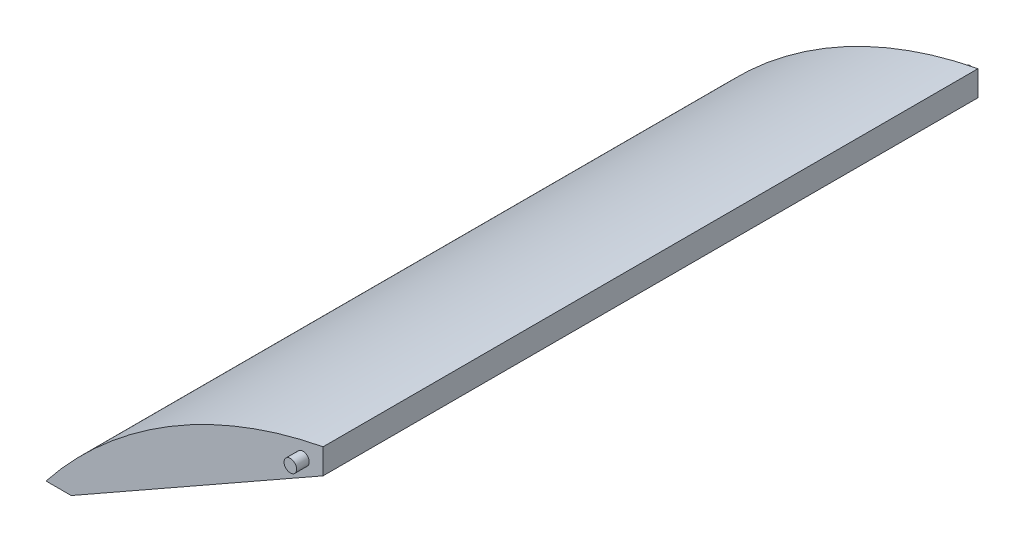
ISO-10303-21;
HEADER;
FILE_DESCRIPTION(('STEP AP214'),'2;1');
FILE_NAME('part.step','',(''),(''),'','','');
FILE_SCHEMA(('AUTOMOTIVE_DESIGN { 1 0 10303 214 1 1 1 1 }'));
ENDSEC;
DATA;
#1=APPLICATION_CONTEXT('core data for automotive mechanical design processes');
#2=APPLICATION_PROTOCOL_DEFINITION('international standard','automotive_design',2000,#1);
#3=PRODUCT_CONTEXT('',#1,'mechanical');
#4=PRODUCT('Part','Part','',(#3));
#5=PRODUCT_RELATED_PRODUCT_CATEGORY('part','',(#4));
#6=PRODUCT_DEFINITION_FORMATION('','',#4);
#7=PRODUCT_DEFINITION_CONTEXT('part definition',#1,'design');
#8=PRODUCT_DEFINITION('design','',#6,#7);
#9=PRODUCT_DEFINITION_SHAPE('','',#8);
#10=(LENGTH_UNIT() NAMED_UNIT(*) SI_UNIT(.MILLI.,.METRE.));
#11=(NAMED_UNIT(*) PLANE_ANGLE_UNIT() SI_UNIT($,.RADIAN.));
#12=(NAMED_UNIT(*) SI_UNIT($,.STERADIAN.) SOLID_ANGLE_UNIT());
#13=UNCERTAINTY_MEASURE_WITH_UNIT(LENGTH_MEASURE(1.E-05),#10,'distance_accuracy_value','');
#14=(GEOMETRIC_REPRESENTATION_CONTEXT(3) GLOBAL_UNCERTAINTY_ASSIGNED_CONTEXT((#13)) GLOBAL_UNIT_ASSIGNED_CONTEXT((#10,
#11,#12)) REPRESENTATION_CONTEXT('',''));
#15=CARTESIAN_POINT('',(0.,0.,0.));
#16=DIRECTION('',(0.,0.,1.));
#17=DIRECTION('',(1.,0.,0.));
#18=AXIS2_PLACEMENT_3D('',#15,#16,#17);
#19=CARTESIAN_POINT('',(145.,-114.887946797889,260.));
#20=DIRECTION('',(0.,0.,-1.));
#21=DIRECTION('',(-1.,0.,0.));
#22=AXIS2_PLACEMENT_3D('',#19,#20,#21);
#23=CYLINDRICAL_SURFACE('',#22,184.997946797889);
#24=CARTESIAN_POINT('',(145.,-114.887946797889,260.));
#25=DIRECTION('',(0.,0.,1.));
#26=DIRECTION('',(1.,0.,0.));
#27=AXIS2_PLACEMENT_3D('',#24,#25,#26);
#28=CIRCLE('',#27,184.997946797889);
#29=CARTESIAN_POINT('',(110.,66.7689834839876,260.));
#30=VERTEX_POINT('',#29);
#31=CARTESIAN_POINT('',(0.,0.,260.));
#32=VERTEX_POINT('',#31);
#33=EDGE_CURVE('E61',#30,#32,#28,.T.);
#34=ORIENTED_EDGE('',*,*,#33,.F.);
#35=DIRECTION('',(0.,0.,-1.));
#36=VECTOR('',#35,1.);
#37=CARTESIAN_POINT('',(110.,66.7689834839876,260.));
#38=LINE('',#37,#36);
#39=CARTESIAN_POINT('',(110.,66.7689834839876,0.));
#40=VERTEX_POINT('',#39);
#41=EDGE_CURVE('E100',#30,#40,#38,.T.);
#42=ORIENTED_EDGE('',*,*,#41,.T.);
#43=CARTESIAN_POINT('',(145.,-114.887946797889,0.));
#44=DIRECTION('',(0.,0.,1.));
#45=DIRECTION('',(1.,0.,0.));
#46=AXIS2_PLACEMENT_3D('',#43,#44,#45);
#47=CIRCLE('',#46,184.997946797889);
#48=CARTESIAN_POINT('',(0.,0.,0.));
#49=VERTEX_POINT('',#48);
#50=EDGE_CURVE('E96',#40,#49,#47,.T.);
#51=ORIENTED_EDGE('',*,*,#50,.T.);
#52=DIRECTION('',(0.,0.,-1.));
#53=VECTOR('',#52,1.);
#54=CARTESIAN_POINT('',(0.,0.,260.));
#55=LINE('',#54,#53);
#56=EDGE_CURVE('E45',#32,#49,#55,.T.);
#57=ORIENTED_EDGE('',*,*,#56,.F.);
#58=EDGE_LOOP('',(#34,#42,#51,#57));
#59=FACE_BOUND('',#58,.T.);
#60=ADVANCED_FACE('F38',(#59),#23,.T.);
#61=CARTESIAN_POINT('',(0.,0.,260.));
#62=DIRECTION('',(0.,1.,0.));
#63=DIRECTION('',(0.,0.,1.));
#64=AXIS2_PLACEMENT_3D('',#61,#62,#63);
#65=PLANE('',#64);
#66=DIRECTION('',(1.,0.,0.));
#67=VECTOR('',#66,1.);
#68=CARTESIAN_POINT('',(0.,0.,0.));
#69=LINE('',#68,#67);
#70=CARTESIAN_POINT('',(10.,0.,0.));
#71=VERTEX_POINT('',#70);
#72=EDGE_CURVE('E91',#49,#71,#69,.T.);
#73=ORIENTED_EDGE('',*,*,#72,.T.);
#74=DIRECTION('',(0.,0.,1.));
#75=VECTOR('',#74,1.);
#76=CARTESIAN_POINT('',(10.,0.,0.));
#77=LINE('',#76,#75);
#78=CARTESIAN_POINT('',(10.,0.,260.));
#79=VERTEX_POINT('',#78);
#80=EDGE_CURVE('E78',#71,#79,#77,.T.);
#81=ORIENTED_EDGE('',*,*,#80,.T.);
#82=DIRECTION('',(1.,0.,0.));
#83=VECTOR('',#82,1.);
#84=CARTESIAN_POINT('',(0.,0.,260.));
#85=LINE('',#84,#83);
#86=EDGE_CURVE('E98',#32,#79,#85,.T.);
#87=ORIENTED_EDGE('',*,*,#86,.F.);
#88=ORIENTED_EDGE('',*,*,#56,.T.);
#89=EDGE_LOOP('',(#73,#81,#87,#88));
#90=FACE_BOUND('',#89,.T.);
#91=ADVANCED_FACE('F94',(#90),#65,.F.);
#92=CARTESIAN_POINT('',(145.,-114.887946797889,260.));
#93=DIRECTION('',(0.,0.,1.));
#94=DIRECTION('',(1.,0.,0.));
#95=AXIS2_PLACEMENT_3D('',#92,#93,#94);
#96=PLANE('',#95);
#97=CARTESIAN_POINT('',(102.,58.7689834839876,260.));
#98=DIRECTION('',(0.,0.,1.));
#99=DIRECTION('',(1.,0.,0.));
#100=AXIS2_PLACEMENT_3D('',#97,#98,#99);
#101=CIRCLE('',#100,2.5);
#102=CARTESIAN_POINT('',(104.5,58.7689834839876,260.));
#103=VERTEX_POINT('',#102);
#104=EDGE_CURVE('E111',#103,#103,#101,.T.);
#105=ORIENTED_EDGE('',*,*,#104,.F.);
#106=EDGE_LOOP('',(#105));
#107=FACE_BOUND('',#106,.T.);
#108=DIRECTION('',(-0.869640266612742,-0.493685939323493,0.));
#109=VECTOR('',#108,1.);
#110=CARTESIAN_POINT('',(10.,0.,260.));
#111=LINE('',#110,#109);
#112=CARTESIAN_POINT('',(110.,56.7689834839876,260.));
#113=VERTEX_POINT('',#112);
#114=EDGE_CURVE('E81',#113,#79,#111,.T.);
#115=ORIENTED_EDGE('',*,*,#114,.F.);
#116=DIRECTION('',(0.,-1.,0.));
#117=VECTOR('',#116,1.);
#118=CARTESIAN_POINT('',(110.,70.11,260.));
#119=LINE('',#118,#117);
#120=EDGE_CURVE('E84',#30,#113,#119,.T.);
#121=ORIENTED_EDGE('',*,*,#120,.F.);
#122=ORIENTED_EDGE('',*,*,#33,.T.);
#123=ORIENTED_EDGE('',*,*,#86,.T.);
#124=EDGE_LOOP('',(#115,#121,#122,#123));
#125=FACE_BOUND('',#124,.T.);
#126=ADVANCED_FACE('F139',(#107,#125),#96,.T.);
#127=CARTESIAN_POINT('',(145.,-114.887946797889,0.));
#128=DIRECTION('',(0.,0.,1.));
#129=DIRECTION('',(1.,0.,0.));
#130=AXIS2_PLACEMENT_3D('',#127,#128,#129);
#131=PLANE('',#130);
#132=CARTESIAN_POINT('',(102.,58.7689834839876,0.));
#133=DIRECTION('',(0.,0.,1.));
#134=DIRECTION('',(1.,0.,0.));
#135=AXIS2_PLACEMENT_3D('',#132,#133,#134);
#136=CIRCLE('',#135,2.5);
#137=CARTESIAN_POINT('',(104.5,58.7689834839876,0.));
#138=VERTEX_POINT('',#137);
#139=EDGE_CURVE('E117',#138,#138,#136,.T.);
#140=ORIENTED_EDGE('',*,*,#139,.T.);
#141=EDGE_LOOP('',(#140));
#142=FACE_BOUND('',#141,.T.);
#143=DIRECTION('',(0.,-1.,0.));
#144=VECTOR('',#143,1.);
#145=CARTESIAN_POINT('',(110.,-114.887946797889,0.));
#146=LINE('',#145,#144);
#147=CARTESIAN_POINT('',(110.,56.7689834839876,0.));
#148=VERTEX_POINT('',#147);
#149=EDGE_CURVE('E11',#40,#148,#146,.T.);
#150=ORIENTED_EDGE('',*,*,#149,.T.);
#151=DIRECTION('',(-0.869640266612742,-0.493685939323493,0.));
#152=VECTOR('',#151,1.);
#153=CARTESIAN_POINT('',(10.,0.,0.));
#154=LINE('',#153,#152);
#155=EDGE_CURVE('E52',#148,#71,#154,.T.);
#156=ORIENTED_EDGE('',*,*,#155,.T.);
#157=ORIENTED_EDGE('',*,*,#72,.F.);
#158=ORIENTED_EDGE('',*,*,#50,.F.);
#159=EDGE_LOOP('',(#150,#156,#157,#158));
#160=FACE_BOUND('',#159,.T.);
#161=ADVANCED_FACE('F89',(#142,#160),#131,.F.);
#162=CARTESIAN_POINT('',(110.,70.11,0.));
#163=DIRECTION('',(-1.,0.,0.));
#164=DIRECTION('',(0.,-1.,0.));
#165=AXIS2_PLACEMENT_3D('',#162,#163,#164);
#166=PLANE('',#165);
#167=ORIENTED_EDGE('',*,*,#120,.T.);
#168=DIRECTION('',(0.,0.,1.));
#169=VECTOR('',#168,1.);
#170=CARTESIAN_POINT('',(110.,56.7689834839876,0.));
#171=LINE('',#170,#169);
#172=EDGE_CURVE('E85',#148,#113,#171,.T.);
#173=ORIENTED_EDGE('',*,*,#172,.F.);
#174=ORIENTED_EDGE('',*,*,#149,.F.);
#175=ORIENTED_EDGE('',*,*,#41,.F.);
#176=EDGE_LOOP('',(#167,#173,#174,#175));
#177=FACE_BOUND('',#176,.T.);
#178=ADVANCED_FACE('F141',(#177),#166,.F.);
#179=CARTESIAN_POINT('',(10.,0.,0.));
#180=DIRECTION('',(-0.493685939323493,0.869640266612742,0.));
#181=DIRECTION('',(-0.869640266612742,-0.493685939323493,0.));
#182=AXIS2_PLACEMENT_3D('',#179,#180,#181);
#183=PLANE('',#182);
#184=ORIENTED_EDGE('',*,*,#114,.T.);
#185=ORIENTED_EDGE('',*,*,#80,.F.);
#186=ORIENTED_EDGE('',*,*,#155,.F.);
#187=ORIENTED_EDGE('',*,*,#172,.T.);
#188=EDGE_LOOP('',(#184,#185,#186,#187));
#189=FACE_BOUND('',#188,.T.);
#190=ADVANCED_FACE('F79',(#189),#183,.F.);
#191=CARTESIAN_POINT('',(102.,58.7689834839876,265.));
#192=DIRECTION('',(0.,0.,-1.));
#193=DIRECTION('',(-1.,0.,0.));
#194=AXIS2_PLACEMENT_3D('',#191,#192,#193);
#195=CYLINDRICAL_SURFACE('',#194,2.5);
#196=CARTESIAN_POINT('',(102.,58.7689834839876,265.));
#197=DIRECTION('',(0.,0.,1.));
#198=DIRECTION('',(1.,0.,0.));
#199=AXIS2_PLACEMENT_3D('',#196,#197,#198);
#200=CIRCLE('',#199,2.5);
#201=CARTESIAN_POINT('',(104.5,58.7689834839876,265.));
#202=VERTEX_POINT('',#201);
#203=EDGE_CURVE('E109',#202,#202,#200,.T.);
#204=ORIENTED_EDGE('',*,*,#203,.F.);
#205=EDGE_LOOP('',(#204));
#206=FACE_BOUND('',#205,.T.);
#207=ORIENTED_EDGE('',*,*,#104,.T.);
#208=EDGE_LOOP('',(#207));
#209=FACE_BOUND('',#208,.T.);
#210=ADVANCED_FACE('F156',(#206,#209),#195,.T.);
#211=CARTESIAN_POINT('',(102.,58.7689834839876,265.));
#212=DIRECTION('',(0.,0.,1.));
#213=DIRECTION('',(1.,0.,0.));
#214=AXIS2_PLACEMENT_3D('',#211,#212,#213);
#215=PLANE('',#214);
#216=ORIENTED_EDGE('',*,*,#203,.T.);
#217=EDGE_LOOP('',(#216));
#218=FACE_BOUND('',#217,.T.);
#219=ADVANCED_FACE('F132',(#218),#215,.T.);
#220=CARTESIAN_POINT('',(102.,58.7689834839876,-5.));
#221=DIRECTION('',(0.,0.,1.));
#222=DIRECTION('',(1.,0.,0.));
#223=AXIS2_PLACEMENT_3D('',#220,#221,#222);
#224=CYLINDRICAL_SURFACE('',#223,2.5);
#225=CARTESIAN_POINT('',(102.,58.7689834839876,-5.));
#226=DIRECTION('',(0.,0.,1.));
#227=DIRECTION('',(1.,0.,0.));
#228=AXIS2_PLACEMENT_3D('',#225,#226,#227);
#229=CIRCLE('',#228,2.5);
#230=CARTESIAN_POINT('',(104.5,58.7689834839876,-5.));
#231=VERTEX_POINT('',#230);
#232=EDGE_CURVE('E114',#231,#231,#229,.T.);
#233=ORIENTED_EDGE('',*,*,#232,.T.);
#234=EDGE_LOOP('',(#233));
#235=FACE_BOUND('',#234,.T.);
#236=ORIENTED_EDGE('',*,*,#139,.F.);
#237=EDGE_LOOP('',(#236));
#238=FACE_BOUND('',#237,.T.);
#239=ADVANCED_FACE('F123',(#235,#238),#224,.T.);
#240=CARTESIAN_POINT('',(102.,58.7689834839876,-5.));
#241=DIRECTION('',(0.,0.,-1.));
#242=DIRECTION('',(1.,0.,0.));
#243=AXIS2_PLACEMENT_3D('',#240,#241,#242);
#244=PLANE('',#243);
#245=ORIENTED_EDGE('',*,*,#232,.F.);
#246=EDGE_LOOP('',(#245));
#247=FACE_BOUND('',#246,.T.);
#248=ADVANCED_FACE('F126',(#247),#244,.T.);
#249=CLOSED_SHELL('',(#60,#91,#126,#161,#178,#190,#210,#219,#239,#248));
#250=MANIFOLD_SOLID_BREP('B2',#249);
#251=ADVANCED_BREP_SHAPE_REPRESENTATION('',(#18,#250),#14);
#252=SHAPE_DEFINITION_REPRESENTATION(#9,#251);
ENDSEC;
END-ISO-10303-21;
